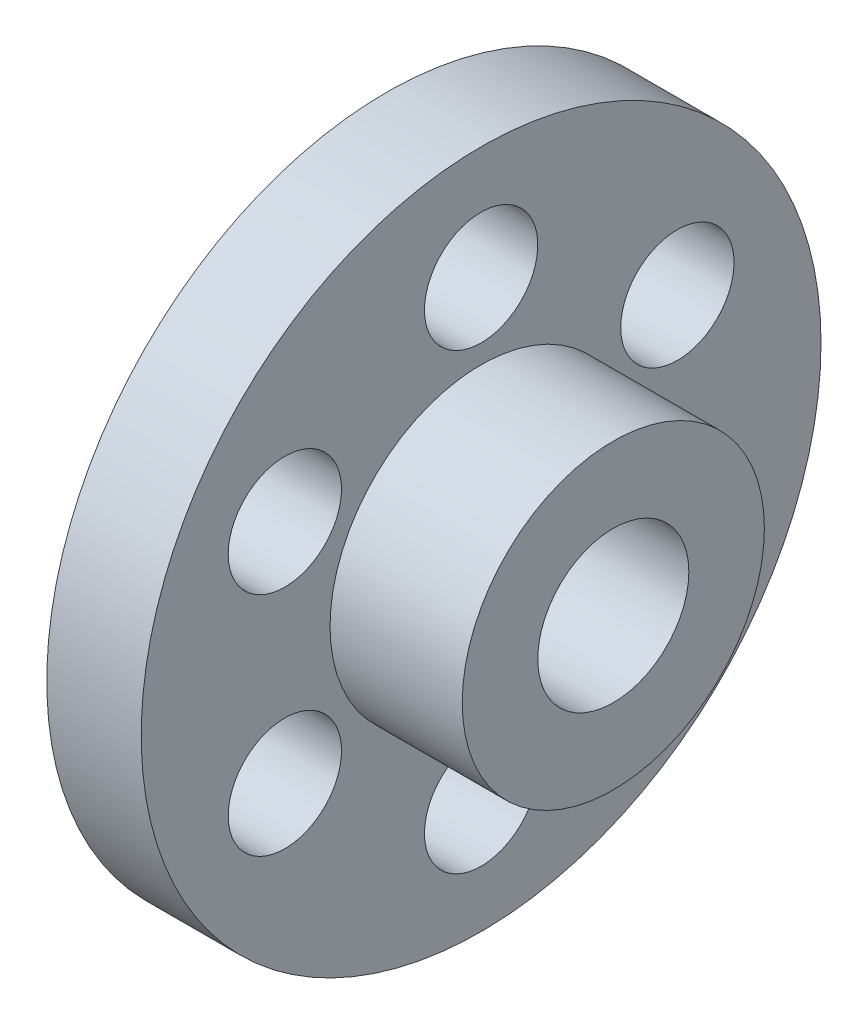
ISO-10303-21;
HEADER;
FILE_DESCRIPTION(('STEP AP214'),'2;1');
FILE_NAME('part.step','',(''),(''),'','','');
FILE_SCHEMA(('AUTOMOTIVE_DESIGN { 1 0 10303 214 1 1 1 1 }'));
ENDSEC;
DATA;
#1=APPLICATION_CONTEXT('core data for automotive mechanical design processes');
#2=APPLICATION_PROTOCOL_DEFINITION('international standard','automotive_design',2000,#1);
#3=PRODUCT_CONTEXT('',#1,'mechanical');
#4=PRODUCT('Part','Part','',(#3));
#5=PRODUCT_RELATED_PRODUCT_CATEGORY('part','',(#4));
#6=PRODUCT_DEFINITION_FORMATION('','',#4);
#7=PRODUCT_DEFINITION_CONTEXT('part definition',#1,'design');
#8=PRODUCT_DEFINITION('design','',#6,#7);
#9=PRODUCT_DEFINITION_SHAPE('','',#8);
#10=(LENGTH_UNIT() NAMED_UNIT(*) SI_UNIT(.MILLI.,.METRE.));
#11=(NAMED_UNIT(*) PLANE_ANGLE_UNIT() SI_UNIT($,.RADIAN.));
#12=(NAMED_UNIT(*) SI_UNIT($,.STERADIAN.) SOLID_ANGLE_UNIT());
#13=UNCERTAINTY_MEASURE_WITH_UNIT(LENGTH_MEASURE(1.E-05),#10,'distance_accuracy_value','');
#14=(GEOMETRIC_REPRESENTATION_CONTEXT(3) GLOBAL_UNCERTAINTY_ASSIGNED_CONTEXT((#13)) GLOBAL_UNIT_ASSIGNED_CONTEXT((#10,
#11,#12)) REPRESENTATION_CONTEXT('',''));
#15=CARTESIAN_POINT('',(0.,0.,0.));
#16=DIRECTION('',(0.,0.,1.));
#17=DIRECTION('',(1.,0.,0.));
#18=AXIS2_PLACEMENT_3D('',#15,#16,#17);
#19=CARTESIAN_POINT('',(0.,0.,0.));
#20=DIRECTION('',(-1.,0.,0.));
#21=DIRECTION('',(0.,0.,1.));
#22=AXIS2_PLACEMENT_3D('',#19,#20,#21);
#23=PLANE('',#22);
#24=CARTESIAN_POINT('',(0.,30.0000000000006,-51.961524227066));
#25=DIRECTION('',(-1.,0.,0.));
#26=DIRECTION('',(0.,0.866025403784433,0.50000000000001));
#27=AXIS2_PLACEMENT_3D('',#24,#25,#26);
#28=CIRCLE('',#27,15.);
#29=CARTESIAN_POINT('',(0.,30.0000000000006,-36.961524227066));
#30=VERTEX_POINT('',#29);
#31=EDGE_CURVE('E109',#30,#30,#28,.T.);
#32=ORIENTED_EDGE('',*,*,#31,.F.);
#33=EDGE_LOOP('',(#32));
#34=FACE_BOUND('',#33,.T.);
#35=CARTESIAN_POINT('',(0.,-29.9999999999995,-51.9615242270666));
#36=DIRECTION('',(-1.,0.,0.));
#37=DIRECTION('',(0.,0.866025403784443,-0.499999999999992));
#38=AXIS2_PLACEMENT_3D('',#35,#36,#37);
#39=CIRCLE('',#38,15.);
#40=CARTESIAN_POINT('',(0.,-29.9999999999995,-36.9615242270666));
#41=VERTEX_POINT('',#40);
#42=EDGE_CURVE('E113',#41,#41,#39,.T.);
#43=ORIENTED_EDGE('',*,*,#42,.F.);
#44=EDGE_LOOP('',(#43));
#45=FACE_BOUND('',#44,.T.);
#46=CARTESIAN_POINT('',(0.,-60.,0.));
#47=DIRECTION('',(-1.,0.,0.));
#48=DIRECTION('',(0.,0.,-1.));
#49=AXIS2_PLACEMENT_3D('',#46,#47,#48);
#50=CIRCLE('',#49,15.);
#51=CARTESIAN_POINT('',(0.,-60.,15.));
#52=VERTEX_POINT('',#51);
#53=EDGE_CURVE('E117',#52,#52,#50,.T.);
#54=ORIENTED_EDGE('',*,*,#53,.F.);
#55=EDGE_LOOP('',(#54));
#56=FACE_BOUND('',#55,.T.);
#57=CARTESIAN_POINT('',(0.,-30.0000000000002,51.9615242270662));
#58=DIRECTION('',(-1.,0.,0.));
#59=DIRECTION('',(0.,-0.866025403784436,-0.500000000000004));
#60=AXIS2_PLACEMENT_3D('',#57,#58,#59);
#61=CIRCLE('',#60,15.);
#62=CARTESIAN_POINT('',(0.,-30.0000000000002,66.9615242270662));
#63=VERTEX_POINT('',#62);
#64=EDGE_CURVE('E121',#63,#63,#61,.T.);
#65=ORIENTED_EDGE('',*,*,#64,.F.);
#66=EDGE_LOOP('',(#65));
#67=FACE_BOUND('',#66,.T.);
#68=CARTESIAN_POINT('',(0.,29.9999999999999,51.9615242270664));
#69=DIRECTION('',(-1.,0.,0.));
#70=DIRECTION('',(0.,-0.86602540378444,0.499999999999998));
#71=AXIS2_PLACEMENT_3D('',#68,#69,#70);
#72=CIRCLE('',#71,15.);
#73=CARTESIAN_POINT('',(0.,29.9999999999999,66.9615242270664));
#74=VERTEX_POINT('',#73);
#75=EDGE_CURVE('E58',#74,#74,#72,.T.);
#76=ORIENTED_EDGE('',*,*,#75,.F.);
#77=EDGE_LOOP('',(#76));
#78=FACE_BOUND('',#77,.T.);
#79=CARTESIAN_POINT('',(0.,60.,0.));
#80=DIRECTION('',(-1.,0.,0.));
#81=DIRECTION('',(0.,0.,1.));
#82=AXIS2_PLACEMENT_3D('',#79,#80,#81);
#83=CIRCLE('',#82,15.);
#84=CARTESIAN_POINT('',(0.,60.,15.));
#85=VERTEX_POINT('',#84);
#86=EDGE_CURVE('E53',#85,#85,#83,.T.);
#87=ORIENTED_EDGE('',*,*,#86,.F.);
#88=EDGE_LOOP('',(#87));
#89=FACE_BOUND('',#88,.T.);
#90=CARTESIAN_POINT('',(0.,0.,0.));
#91=DIRECTION('',(1.,0.,0.));
#92=DIRECTION('',(0.,0.,-1.));
#93=AXIS2_PLACEMENT_3D('',#90,#91,#92);
#94=CIRCLE('',#93,20.);
#95=CARTESIAN_POINT('',(0.,0.,-20.));
#96=VERTEX_POINT('',#95);
#97=EDGE_CURVE('E77',#96,#96,#94,.T.);
#98=ORIENTED_EDGE('',*,*,#97,.T.);
#99=EDGE_LOOP('',(#98));
#100=FACE_BOUND('',#99,.T.);
#101=CARTESIAN_POINT('',(0.,0.,0.));
#102=DIRECTION('',(1.,0.,0.));
#103=DIRECTION('',(0.,0.,-1.));
#104=AXIS2_PLACEMENT_3D('',#101,#102,#103);
#105=CIRCLE('',#104,90.);
#106=CARTESIAN_POINT('',(0.,0.,-90.));
#107=VERTEX_POINT('',#106);
#108=EDGE_CURVE('E10',#107,#107,#105,.T.);
#109=ORIENTED_EDGE('',*,*,#108,.F.);
#110=EDGE_LOOP('',(#109));
#111=FACE_BOUND('',#110,.T.);
#112=ADVANCED_FACE('F33',(#34,#45,#56,#67,#78,#89,#100,#111),#23,.T.);
#113=CARTESIAN_POINT('',(0.,0.,0.));
#114=DIRECTION('',(1.,0.,0.));
#115=DIRECTION('',(0.,0.,-1.));
#116=AXIS2_PLACEMENT_3D('',#113,#114,#115);
#117=CYLINDRICAL_SURFACE('',#116,90.);
#118=ORIENTED_EDGE('',*,*,#108,.T.);
#119=EDGE_LOOP('',(#118));
#120=FACE_BOUND('',#119,.T.);
#121=CARTESIAN_POINT('',(25.,0.,0.));
#122=DIRECTION('',(1.,0.,0.));
#123=DIRECTION('',(0.,0.,-1.));
#124=AXIS2_PLACEMENT_3D('',#121,#122,#123);
#125=CIRCLE('',#124,90.);
#126=CARTESIAN_POINT('',(25.,0.,-90.));
#127=VERTEX_POINT('',#126);
#128=EDGE_CURVE('E40',#127,#127,#125,.T.);
#129=ORIENTED_EDGE('',*,*,#128,.F.);
#130=EDGE_LOOP('',(#129));
#131=FACE_BOUND('',#130,.T.);
#132=ADVANCED_FACE('F92',(#120,#131),#117,.T.);
#133=CARTESIAN_POINT('',(25.,90.,0.));
#134=DIRECTION('',(1.,0.,0.));
#135=DIRECTION('',(0.,0.,-1.));
#136=AXIS2_PLACEMENT_3D('',#133,#134,#135);
#137=PLANE('',#136);
#138=CARTESIAN_POINT('',(25.,30.0000000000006,-51.961524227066));
#139=DIRECTION('',(1.,0.,0.));
#140=DIRECTION('',(0.,0.,-1.));
#141=AXIS2_PLACEMENT_3D('',#138,#139,#140);
#142=CIRCLE('',#141,15.);
#143=CARTESIAN_POINT('',(25.,30.0000000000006,-36.961524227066));
#144=VERTEX_POINT('',#143);
#145=EDGE_CURVE('E36',#144,#144,#142,.T.);
#146=ORIENTED_EDGE('',*,*,#145,.F.);
#147=EDGE_LOOP('',(#146));
#148=FACE_BOUND('',#147,.T.);
#149=CARTESIAN_POINT('',(25.,-29.9999999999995,-51.9615242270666));
#150=DIRECTION('',(1.,0.,0.));
#151=DIRECTION('',(0.,0.,-1.));
#152=AXIS2_PLACEMENT_3D('',#149,#150,#151);
#153=CIRCLE('',#152,15.);
#154=CARTESIAN_POINT('',(25.,-29.9999999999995,-36.9615242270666));
#155=VERTEX_POINT('',#154);
#156=EDGE_CURVE('E63',#155,#155,#153,.T.);
#157=ORIENTED_EDGE('',*,*,#156,.F.);
#158=EDGE_LOOP('',(#157));
#159=FACE_BOUND('',#158,.T.);
#160=CARTESIAN_POINT('',(25.,-60.,0.));
#161=DIRECTION('',(1.,0.,0.));
#162=DIRECTION('',(0.,0.,-1.));
#163=AXIS2_PLACEMENT_3D('',#160,#161,#162);
#164=CIRCLE('',#163,15.);
#165=CARTESIAN_POINT('',(25.,-60.,15.));
#166=VERTEX_POINT('',#165);
#167=EDGE_CURVE('E61',#166,#166,#164,.T.);
#168=ORIENTED_EDGE('',*,*,#167,.F.);
#169=EDGE_LOOP('',(#168));
#170=FACE_BOUND('',#169,.T.);
#171=CARTESIAN_POINT('',(25.,-30.0000000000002,51.9615242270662));
#172=DIRECTION('',(1.,0.,0.));
#173=DIRECTION('',(0.,0.,-1.));
#174=AXIS2_PLACEMENT_3D('',#171,#172,#173);
#175=CIRCLE('',#174,15.);
#176=CARTESIAN_POINT('',(25.,-30.0000000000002,66.9615242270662));
#177=VERTEX_POINT('',#176);
#178=EDGE_CURVE('E57',#177,#177,#175,.T.);
#179=ORIENTED_EDGE('',*,*,#178,.F.);
#180=EDGE_LOOP('',(#179));
#181=FACE_BOUND('',#180,.T.);
#182=CARTESIAN_POINT('',(25.,29.9999999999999,51.9615242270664));
#183=DIRECTION('',(1.,0.,0.));
#184=DIRECTION('',(0.,0.,-1.));
#185=AXIS2_PLACEMENT_3D('',#182,#183,#184);
#186=CIRCLE('',#185,15.);
#187=CARTESIAN_POINT('',(25.,29.9999999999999,66.9615242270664));
#188=VERTEX_POINT('',#187);
#189=EDGE_CURVE('E54',#188,#188,#186,.T.);
#190=ORIENTED_EDGE('',*,*,#189,.F.);
#191=EDGE_LOOP('',(#190));
#192=FACE_BOUND('',#191,.T.);
#193=CARTESIAN_POINT('',(25.,60.,0.));
#194=DIRECTION('',(1.,0.,0.));
#195=DIRECTION('',(0.,0.,-1.));
#196=AXIS2_PLACEMENT_3D('',#193,#194,#195);
#197=CIRCLE('',#196,15.);
#198=CARTESIAN_POINT('',(25.,60.,15.));
#199=VERTEX_POINT('',#198);
#200=EDGE_CURVE('E49',#199,#199,#197,.T.);
#201=ORIENTED_EDGE('',*,*,#200,.F.);
#202=EDGE_LOOP('',(#201));
#203=FACE_BOUND('',#202,.T.);
#204=ORIENTED_EDGE('',*,*,#128,.T.);
#205=EDGE_LOOP('',(#204));
#206=FACE_BOUND('',#205,.T.);
#207=CARTESIAN_POINT('',(25.,0.,0.));
#208=DIRECTION('',(1.,0.,0.));
#209=DIRECTION('',(0.,0.,-1.));
#210=AXIS2_PLACEMENT_3D('',#207,#208,#209);
#211=CIRCLE('',#210,40.);
#212=CARTESIAN_POINT('',(25.,0.,-40.));
#213=VERTEX_POINT('',#212);
#214=EDGE_CURVE('E45',#213,#213,#211,.T.);
#215=ORIENTED_EDGE('',*,*,#214,.F.);
#216=EDGE_LOOP('',(#215));
#217=FACE_BOUND('',#216,.T.);
#218=ADVANCED_FACE('F90',(#148,#159,#170,#181,#192,#203,#206,#217),#137,.T.);
#219=CARTESIAN_POINT('',(0.,0.,0.));
#220=DIRECTION('',(1.,0.,0.));
#221=DIRECTION('',(0.,0.,-1.));
#222=AXIS2_PLACEMENT_3D('',#219,#220,#221);
#223=CYLINDRICAL_SURFACE('',#222,40.);
#224=ORIENTED_EDGE('',*,*,#214,.T.);
#225=EDGE_LOOP('',(#224));
#226=FACE_BOUND('',#225,.T.);
#227=CARTESIAN_POINT('',(60.,0.,0.));
#228=DIRECTION('',(1.,0.,0.));
#229=DIRECTION('',(0.,0.,-1.));
#230=AXIS2_PLACEMENT_3D('',#227,#228,#229);
#231=CIRCLE('',#230,40.);
#232=CARTESIAN_POINT('',(60.,0.,-40.));
#233=VERTEX_POINT('',#232);
#234=EDGE_CURVE('E80',#233,#233,#231,.T.);
#235=ORIENTED_EDGE('',*,*,#234,.F.);
#236=EDGE_LOOP('',(#235));
#237=FACE_BOUND('',#236,.T.);
#238=ADVANCED_FACE('F87',(#226,#237),#223,.T.);
#239=CARTESIAN_POINT('',(60.,40.,0.));
#240=DIRECTION('',(1.,0.,0.));
#241=DIRECTION('',(0.,0.,-1.));
#242=AXIS2_PLACEMENT_3D('',#239,#240,#241);
#243=PLANE('',#242);
#244=CARTESIAN_POINT('',(60.,0.,0.));
#245=DIRECTION('',(1.,0.,0.));
#246=DIRECTION('',(0.,0.,-1.));
#247=AXIS2_PLACEMENT_3D('',#244,#245,#246);
#248=CIRCLE('',#247,20.);
#249=CARTESIAN_POINT('',(60.,0.,-20.));
#250=VERTEX_POINT('',#249);
#251=EDGE_CURVE('E52',#250,#250,#248,.T.);
#252=ORIENTED_EDGE('',*,*,#251,.F.);
#253=EDGE_LOOP('',(#252));
#254=FACE_BOUND('',#253,.T.);
#255=ORIENTED_EDGE('',*,*,#234,.T.);
#256=EDGE_LOOP('',(#255));
#257=FACE_BOUND('',#256,.T.);
#258=ADVANCED_FACE('F99',(#254,#257),#243,.T.);
#259=CARTESIAN_POINT('',(0.,0.,0.));
#260=DIRECTION('',(1.,0.,0.));
#261=DIRECTION('',(0.,0.,-1.));
#262=AXIS2_PLACEMENT_3D('',#259,#260,#261);
#263=CYLINDRICAL_SURFACE('',#262,20.);
#264=ORIENTED_EDGE('',*,*,#97,.F.);
#265=EDGE_LOOP('',(#264));
#266=FACE_BOUND('',#265,.T.);
#267=ORIENTED_EDGE('',*,*,#251,.T.);
#268=EDGE_LOOP('',(#267));
#269=FACE_BOUND('',#268,.T.);
#270=ADVANCED_FACE('F129',(#266,#269),#263,.F.);
#271=CARTESIAN_POINT('',(60.,60.,0.));
#272=DIRECTION('',(-1.,0.,0.));
#273=DIRECTION('',(0.,0.,1.));
#274=AXIS2_PLACEMENT_3D('',#271,#272,#273);
#275=CYLINDRICAL_SURFACE('',#274,15.);
#276=CARTESIAN_POINT('',(25.,60.,15.));
#277=CARTESIAN_POINT('',(24.7395833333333,60.,15.));
#278=CARTESIAN_POINT('',(24.4791666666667,60.,15.));
#279=CARTESIAN_POINT('',(23.9583333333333,60.,15.));
#280=CARTESIAN_POINT('',(23.6979166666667,60.,15.));
#281=CARTESIAN_POINT('',(23.1770833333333,60.,15.));
#282=CARTESIAN_POINT('',(22.9166666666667,60.,15.));
#283=CARTESIAN_POINT('',(22.3958333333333,60.,15.));
#284=CARTESIAN_POINT('',(22.1354166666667,60.,15.));
#285=CARTESIAN_POINT('',(21.6145833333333,60.,15.));
#286=CARTESIAN_POINT('',(21.3541666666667,60.,15.));
#287=CARTESIAN_POINT('',(20.8333333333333,60.,15.));
#288=CARTESIAN_POINT('',(20.5729166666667,60.,15.));
#289=CARTESIAN_POINT('',(20.0520833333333,60.,15.));
#290=CARTESIAN_POINT('',(19.7916666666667,60.,15.));
#291=CARTESIAN_POINT('',(19.2708333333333,60.,15.));
#292=CARTESIAN_POINT('',(19.0104166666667,60.,15.));
#293=CARTESIAN_POINT('',(18.4895833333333,60.,15.));
#294=CARTESIAN_POINT('',(18.2291666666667,60.,15.));
#295=CARTESIAN_POINT('',(17.7083333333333,60.,15.));
#296=CARTESIAN_POINT('',(17.4479166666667,60.,15.));
#297=CARTESIAN_POINT('',(16.9270833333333,60.,15.));
#298=CARTESIAN_POINT('',(16.6666666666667,60.,15.));
#299=CARTESIAN_POINT('',(16.1458333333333,60.,15.));
#300=CARTESIAN_POINT('',(15.8854166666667,60.,15.));
#301=CARTESIAN_POINT('',(15.3645833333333,60.,15.));
#302=CARTESIAN_POINT('',(15.1041666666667,60.,15.));
#303=CARTESIAN_POINT('',(14.5833333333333,60.,15.));
#304=CARTESIAN_POINT('',(14.3229166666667,60.,15.));
#305=CARTESIAN_POINT('',(13.8020833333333,60.,15.));
#306=CARTESIAN_POINT('',(13.5416666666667,60.,15.));
#307=CARTESIAN_POINT('',(13.0208333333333,60.,15.));
#308=CARTESIAN_POINT('',(12.7604166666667,60.,15.));
#309=CARTESIAN_POINT('',(12.2395833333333,60.,15.));
#310=CARTESIAN_POINT('',(11.9791666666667,60.,15.));
#311=CARTESIAN_POINT('',(11.4583333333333,60.,15.));
#312=CARTESIAN_POINT('',(11.1979166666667,60.,15.));
#313=CARTESIAN_POINT('',(10.6770833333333,60.,15.));
#314=CARTESIAN_POINT('',(10.4166666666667,60.,15.));
#315=CARTESIAN_POINT('',(9.89583333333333,60.,15.));
#316=CARTESIAN_POINT('',(9.63541666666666,60.,15.));
#317=CARTESIAN_POINT('',(9.11458333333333,60.,15.));
#318=CARTESIAN_POINT('',(8.85416666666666,60.,15.));
#319=CARTESIAN_POINT('',(8.33333333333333,60.,15.));
#320=CARTESIAN_POINT('',(8.07291666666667,60.,15.));
#321=CARTESIAN_POINT('',(7.55208333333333,60.,15.));
#322=CARTESIAN_POINT('',(7.29166666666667,60.,15.));
#323=CARTESIAN_POINT('',(6.77083333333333,60.,15.));
#324=CARTESIAN_POINT('',(6.51041666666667,60.,15.));
#325=CARTESIAN_POINT('',(5.98958333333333,60.,15.));
#326=CARTESIAN_POINT('',(5.72916666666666,60.,15.));
#327=CARTESIAN_POINT('',(5.20833333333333,60.,15.));
#328=CARTESIAN_POINT('',(4.94791666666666,60.,15.));
#329=CARTESIAN_POINT('',(4.42708333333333,60.,15.));
#330=CARTESIAN_POINT('',(4.16666666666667,60.,15.));
#331=CARTESIAN_POINT('',(3.64583333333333,60.,15.));
#332=CARTESIAN_POINT('',(3.38541666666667,60.,15.));
#333=CARTESIAN_POINT('',(2.86458333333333,60.,15.));
#334=CARTESIAN_POINT('',(2.60416666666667,60.,15.));
#335=CARTESIAN_POINT('',(2.08333333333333,60.,15.));
#336=CARTESIAN_POINT('',(1.82291666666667,60.,15.));
#337=CARTESIAN_POINT('',(1.30208333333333,60.,15.));
#338=CARTESIAN_POINT('',(1.04166666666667,60.,15.));
#339=CARTESIAN_POINT('',(0.520833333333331,60.,15.));
#340=CARTESIAN_POINT('',(0.260416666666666,60.,15.));
#341=CARTESIAN_POINT('',(0.,60.,15.));
#342=B_SPLINE_CURVE_WITH_KNOTS('',3,(#276,#277,#278,#279,#280,#281,#282,#283,#284,#285,#286,
#287,#288,#289,#290,#291,#292,#293,#294,#295,#296,#297,#298,#299,#300,#301,#302,#303,#304,#305,
#306,#307,#308,#309,#310,#311,#312,#313,#314,#315,#316,#317,#318,#319,#320,#321,#322,#323,#324,
#325,#326,#327,#328,#329,#330,#331,#332,#333,#334,#335,#336,#337,#338,#339,#340,#341),
.UNSPECIFIED.,.F.,.F.,(4,2,2,2,2,2,2,2,2,2,2,2,2,2,2,2,2,2,2,2,2,2,2,2,2,2,2,2,2,2,2,2,4),(0.,
0.781249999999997,1.5625,2.34375,3.125,3.90625,4.6875,5.46875,6.25,7.03125,7.8125,8.59375,
9.37499999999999,10.15625,10.9375,11.71875,12.5,13.28125,14.0625,14.84375,15.625,16.40625,
17.1875,17.96875,18.75,19.53125,20.3125,21.09375,21.875,22.65625,23.4375,24.21875,25.),.UNSPECIFIED.);
#343=EDGE_CURVE('BSEAM132',#199,#85,#342,.T.);
#344=ORIENTED_EDGE('',*,*,#200,.T.);
#345=ORIENTED_EDGE('',*,*,#86,.T.);
#346=ORIENTED_EDGE('',*,*,#343,.T.);
#347=ORIENTED_EDGE('',*,*,#343,.F.);
#348=EDGE_LOOP('',(#344,#346,#345,#347));
#349=FACE_BOUND('',#348,.T.);
#350=ADVANCED_FACE('F132',(#349),#275,.F.);
#351=CARTESIAN_POINT('',(60.,29.9999999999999,51.9615242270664));
#352=DIRECTION('',(-1.,0.,0.));
#353=DIRECTION('',(0.,0.,1.));
#354=AXIS2_PLACEMENT_3D('',#351,#352,#353);
#355=CYLINDRICAL_SURFACE('',#354,15.);
#356=CARTESIAN_POINT('',(25.,29.9999999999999,66.9615242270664));
#357=CARTESIAN_POINT('',(24.7395833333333,29.9999999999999,66.9615242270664));
#358=CARTESIAN_POINT('',(24.4791666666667,29.9999999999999,66.9615242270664));
#359=CARTESIAN_POINT('',(23.9583333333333,29.9999999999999,66.9615242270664));
#360=CARTESIAN_POINT('',(23.6979166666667,29.9999999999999,66.9615242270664));
#361=CARTESIAN_POINT('',(23.1770833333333,29.9999999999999,66.9615242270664));
#362=CARTESIAN_POINT('',(22.9166666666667,29.9999999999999,66.9615242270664));
#363=CARTESIAN_POINT('',(22.3958333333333,29.9999999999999,66.9615242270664));
#364=CARTESIAN_POINT('',(22.1354166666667,29.9999999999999,66.9615242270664));
#365=CARTESIAN_POINT('',(21.6145833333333,29.9999999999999,66.9615242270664));
#366=CARTESIAN_POINT('',(21.3541666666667,29.9999999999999,66.9615242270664));
#367=CARTESIAN_POINT('',(20.8333333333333,29.9999999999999,66.9615242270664));
#368=CARTESIAN_POINT('',(20.5729166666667,29.9999999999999,66.9615242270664));
#369=CARTESIAN_POINT('',(20.0520833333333,29.9999999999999,66.9615242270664));
#370=CARTESIAN_POINT('',(19.7916666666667,29.9999999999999,66.9615242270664));
#371=CARTESIAN_POINT('',(19.2708333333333,29.9999999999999,66.9615242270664));
#372=CARTESIAN_POINT('',(19.0104166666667,29.9999999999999,66.9615242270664));
#373=CARTESIAN_POINT('',(18.4895833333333,29.9999999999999,66.9615242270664));
#374=CARTESIAN_POINT('',(18.2291666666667,29.9999999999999,66.9615242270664));
#375=CARTESIAN_POINT('',(17.7083333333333,29.9999999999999,66.9615242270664));
#376=CARTESIAN_POINT('',(17.4479166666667,29.9999999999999,66.9615242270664));
#377=CARTESIAN_POINT('',(16.9270833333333,29.9999999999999,66.9615242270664));
#378=CARTESIAN_POINT('',(16.6666666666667,29.9999999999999,66.9615242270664));
#379=CARTESIAN_POINT('',(16.1458333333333,29.9999999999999,66.9615242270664));
#380=CARTESIAN_POINT('',(15.8854166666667,29.9999999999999,66.9615242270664));
#381=CARTESIAN_POINT('',(15.3645833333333,29.9999999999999,66.9615242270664));
#382=CARTESIAN_POINT('',(15.1041666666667,29.9999999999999,66.9615242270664));
#383=CARTESIAN_POINT('',(14.5833333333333,29.9999999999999,66.9615242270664));
#384=CARTESIAN_POINT('',(14.3229166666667,29.9999999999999,66.9615242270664));
#385=CARTESIAN_POINT('',(13.8020833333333,29.9999999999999,66.9615242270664));
#386=CARTESIAN_POINT('',(13.5416666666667,29.9999999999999,66.9615242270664));
#387=CARTESIAN_POINT('',(13.0208333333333,29.9999999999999,66.9615242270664));
#388=CARTESIAN_POINT('',(12.7604166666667,29.9999999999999,66.9615242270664));
#389=CARTESIAN_POINT('',(12.2395833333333,29.9999999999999,66.9615242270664));
#390=CARTESIAN_POINT('',(11.9791666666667,29.9999999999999,66.9615242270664));
#391=CARTESIAN_POINT('',(11.4583333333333,29.9999999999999,66.9615242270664));
#392=CARTESIAN_POINT('',(11.1979166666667,29.9999999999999,66.9615242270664));
#393=CARTESIAN_POINT('',(10.6770833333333,29.9999999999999,66.9615242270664));
#394=CARTESIAN_POINT('',(10.4166666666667,29.9999999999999,66.9615242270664));
#395=CARTESIAN_POINT('',(9.89583333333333,29.9999999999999,66.9615242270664));
#396=CARTESIAN_POINT('',(9.63541666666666,29.9999999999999,66.9615242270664));
#397=CARTESIAN_POINT('',(9.11458333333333,29.9999999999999,66.9615242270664));
#398=CARTESIAN_POINT('',(8.85416666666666,29.9999999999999,66.9615242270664));
#399=CARTESIAN_POINT('',(8.33333333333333,29.9999999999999,66.9615242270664));
#400=CARTESIAN_POINT('',(8.07291666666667,29.9999999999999,66.9615242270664));
#401=CARTESIAN_POINT('',(7.55208333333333,29.9999999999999,66.9615242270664));
#402=CARTESIAN_POINT('',(7.29166666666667,29.9999999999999,66.9615242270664));
#403=CARTESIAN_POINT('',(6.77083333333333,29.9999999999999,66.9615242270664));
#404=CARTESIAN_POINT('',(6.51041666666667,29.9999999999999,66.9615242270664));
#405=CARTESIAN_POINT('',(5.98958333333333,29.9999999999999,66.9615242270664));
#406=CARTESIAN_POINT('',(5.72916666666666,29.9999999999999,66.9615242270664));
#407=CARTESIAN_POINT('',(5.20833333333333,29.9999999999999,66.9615242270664));
#408=CARTESIAN_POINT('',(4.94791666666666,29.9999999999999,66.9615242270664));
#409=CARTESIAN_POINT('',(4.42708333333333,29.9999999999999,66.9615242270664));
#410=CARTESIAN_POINT('',(4.16666666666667,29.9999999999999,66.9615242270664));
#411=CARTESIAN_POINT('',(3.64583333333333,29.9999999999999,66.9615242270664));
#412=CARTESIAN_POINT('',(3.38541666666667,29.9999999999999,66.9615242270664));
#413=CARTESIAN_POINT('',(2.86458333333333,29.9999999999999,66.9615242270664));
#414=CARTESIAN_POINT('',(2.60416666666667,29.9999999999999,66.9615242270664));
#415=CARTESIAN_POINT('',(2.08333333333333,29.9999999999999,66.9615242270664));
#416=CARTESIAN_POINT('',(1.82291666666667,29.9999999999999,66.9615242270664));
#417=CARTESIAN_POINT('',(1.30208333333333,29.9999999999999,66.9615242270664));
#418=CARTESIAN_POINT('',(1.04166666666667,29.9999999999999,66.9615242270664));
#419=CARTESIAN_POINT('',(0.520833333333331,29.9999999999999,66.9615242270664));
#420=CARTESIAN_POINT('',(0.260416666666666,29.9999999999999,66.9615242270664));
#421=CARTESIAN_POINT('',(0.,29.9999999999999,66.9615242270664));
#422=B_SPLINE_CURVE_WITH_KNOTS('',3,(#356,#357,#358,#359,#360,#361,#362,#363,#364,#365,#366,
#367,#368,#369,#370,#371,#372,#373,#374,#375,#376,#377,#378,#379,#380,#381,#382,#383,#384,#385,
#386,#387,#388,#389,#390,#391,#392,#393,#394,#395,#396,#397,#398,#399,#400,#401,#402,#403,#404,
#405,#406,#407,#408,#409,#410,#411,#412,#413,#414,#415,#416,#417,#418,#419,#420,#421),
.UNSPECIFIED.,.F.,.F.,(4,2,2,2,2,2,2,2,2,2,2,2,2,2,2,2,2,2,2,2,2,2,2,2,2,2,2,2,2,2,2,2,4),(0.,
0.781249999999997,1.5625,2.34375,3.125,3.90625,4.6875,5.46875,6.25,7.03125,7.8125,8.59375,
9.37499999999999,10.15625,10.9375,11.71875,12.5,13.28125,14.0625,14.84375,15.625,16.40625,
17.1875,17.96875,18.75,19.53125,20.3125,21.09375,21.875,22.65625,23.4375,24.21875,25.),.UNSPECIFIED.);
#423=EDGE_CURVE('BSEAM145',#188,#74,#422,.T.);
#424=ORIENTED_EDGE('',*,*,#189,.T.);
#425=ORIENTED_EDGE('',*,*,#75,.T.);
#426=ORIENTED_EDGE('',*,*,#423,.T.);
#427=ORIENTED_EDGE('',*,*,#423,.F.);
#428=EDGE_LOOP('',(#424,#426,#425,#427));
#429=FACE_BOUND('',#428,.T.);
#430=ADVANCED_FACE('F145',(#429),#355,.F.);
#431=CARTESIAN_POINT('',(60.,-30.0000000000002,51.9615242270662));
#432=DIRECTION('',(-1.,0.,0.));
#433=DIRECTION('',(0.,0.,1.));
#434=AXIS2_PLACEMENT_3D('',#431,#432,#433);
#435=CYLINDRICAL_SURFACE('',#434,15.);
#436=CARTESIAN_POINT('',(25.,-30.0000000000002,66.9615242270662));
#437=CARTESIAN_POINT('',(24.7395833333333,-30.0000000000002,66.9615242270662));
#438=CARTESIAN_POINT('',(24.4791666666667,-30.0000000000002,66.9615242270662));
#439=CARTESIAN_POINT('',(23.9583333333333,-30.0000000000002,66.9615242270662));
#440=CARTESIAN_POINT('',(23.6979166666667,-30.0000000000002,66.9615242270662));
#441=CARTESIAN_POINT('',(23.1770833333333,-30.0000000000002,66.9615242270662));
#442=CARTESIAN_POINT('',(22.9166666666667,-30.0000000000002,66.9615242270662));
#443=CARTESIAN_POINT('',(22.3958333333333,-30.0000000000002,66.9615242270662));
#444=CARTESIAN_POINT('',(22.1354166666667,-30.0000000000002,66.9615242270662));
#445=CARTESIAN_POINT('',(21.6145833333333,-30.0000000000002,66.9615242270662));
#446=CARTESIAN_POINT('',(21.3541666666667,-30.0000000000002,66.9615242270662));
#447=CARTESIAN_POINT('',(20.8333333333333,-30.0000000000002,66.9615242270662));
#448=CARTESIAN_POINT('',(20.5729166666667,-30.0000000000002,66.9615242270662));
#449=CARTESIAN_POINT('',(20.0520833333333,-30.0000000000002,66.9615242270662));
#450=CARTESIAN_POINT('',(19.7916666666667,-30.0000000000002,66.9615242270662));
#451=CARTESIAN_POINT('',(19.2708333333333,-30.0000000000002,66.9615242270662));
#452=CARTESIAN_POINT('',(19.0104166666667,-30.0000000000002,66.9615242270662));
#453=CARTESIAN_POINT('',(18.4895833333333,-30.0000000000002,66.9615242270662));
#454=CARTESIAN_POINT('',(18.2291666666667,-30.0000000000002,66.9615242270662));
#455=CARTESIAN_POINT('',(17.7083333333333,-30.0000000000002,66.9615242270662));
#456=CARTESIAN_POINT('',(17.4479166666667,-30.0000000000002,66.9615242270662));
#457=CARTESIAN_POINT('',(16.9270833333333,-30.0000000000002,66.9615242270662));
#458=CARTESIAN_POINT('',(16.6666666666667,-30.0000000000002,66.9615242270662));
#459=CARTESIAN_POINT('',(16.1458333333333,-30.0000000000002,66.9615242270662));
#460=CARTESIAN_POINT('',(15.8854166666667,-30.0000000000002,66.9615242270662));
#461=CARTESIAN_POINT('',(15.3645833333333,-30.0000000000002,66.9615242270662));
#462=CARTESIAN_POINT('',(15.1041666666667,-30.0000000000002,66.9615242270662));
#463=CARTESIAN_POINT('',(14.5833333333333,-30.0000000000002,66.9615242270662));
#464=CARTESIAN_POINT('',(14.3229166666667,-30.0000000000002,66.9615242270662));
#465=CARTESIAN_POINT('',(13.8020833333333,-30.0000000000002,66.9615242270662));
#466=CARTESIAN_POINT('',(13.5416666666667,-30.0000000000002,66.9615242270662));
#467=CARTESIAN_POINT('',(13.0208333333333,-30.0000000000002,66.9615242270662));
#468=CARTESIAN_POINT('',(12.7604166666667,-30.0000000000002,66.9615242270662));
#469=CARTESIAN_POINT('',(12.2395833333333,-30.0000000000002,66.9615242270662));
#470=CARTESIAN_POINT('',(11.9791666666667,-30.0000000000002,66.9615242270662));
#471=CARTESIAN_POINT('',(11.4583333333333,-30.0000000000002,66.9615242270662));
#472=CARTESIAN_POINT('',(11.1979166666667,-30.0000000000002,66.9615242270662));
#473=CARTESIAN_POINT('',(10.6770833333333,-30.0000000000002,66.9615242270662));
#474=CARTESIAN_POINT('',(10.4166666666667,-30.0000000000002,66.9615242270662));
#475=CARTESIAN_POINT('',(9.89583333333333,-30.0000000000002,66.9615242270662));
#476=CARTESIAN_POINT('',(9.63541666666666,-30.0000000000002,66.9615242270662));
#477=CARTESIAN_POINT('',(9.11458333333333,-30.0000000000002,66.9615242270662));
#478=CARTESIAN_POINT('',(8.85416666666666,-30.0000000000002,66.9615242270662));
#479=CARTESIAN_POINT('',(8.33333333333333,-30.0000000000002,66.9615242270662));
#480=CARTESIAN_POINT('',(8.07291666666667,-30.0000000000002,66.9615242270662));
#481=CARTESIAN_POINT('',(7.55208333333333,-30.0000000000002,66.9615242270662));
#482=CARTESIAN_POINT('',(7.29166666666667,-30.0000000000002,66.9615242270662));
#483=CARTESIAN_POINT('',(6.77083333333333,-30.0000000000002,66.9615242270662));
#484=CARTESIAN_POINT('',(6.51041666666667,-30.0000000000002,66.9615242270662));
#485=CARTESIAN_POINT('',(5.98958333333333,-30.0000000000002,66.9615242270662));
#486=CARTESIAN_POINT('',(5.72916666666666,-30.0000000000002,66.9615242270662));
#487=CARTESIAN_POINT('',(5.20833333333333,-30.0000000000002,66.9615242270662));
#488=CARTESIAN_POINT('',(4.94791666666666,-30.0000000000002,66.9615242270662));
#489=CARTESIAN_POINT('',(4.42708333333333,-30.0000000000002,66.9615242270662));
#490=CARTESIAN_POINT('',(4.16666666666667,-30.0000000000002,66.9615242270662));
#491=CARTESIAN_POINT('',(3.64583333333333,-30.0000000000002,66.9615242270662));
#492=CARTESIAN_POINT('',(3.38541666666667,-30.0000000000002,66.9615242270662));
#493=CARTESIAN_POINT('',(2.86458333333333,-30.0000000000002,66.9615242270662));
#494=CARTESIAN_POINT('',(2.60416666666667,-30.0000000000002,66.9615242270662));
#495=CARTESIAN_POINT('',(2.08333333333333,-30.0000000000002,66.9615242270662));
#496=CARTESIAN_POINT('',(1.82291666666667,-30.0000000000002,66.9615242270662));
#497=CARTESIAN_POINT('',(1.30208333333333,-30.0000000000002,66.9615242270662));
#498=CARTESIAN_POINT('',(1.04166666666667,-30.0000000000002,66.9615242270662));
#499=CARTESIAN_POINT('',(0.520833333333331,-30.0000000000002,66.9615242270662));
#500=CARTESIAN_POINT('',(0.260416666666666,-30.0000000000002,66.9615242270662));
#501=CARTESIAN_POINT('',(0.,-30.0000000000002,66.9615242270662));
#502=B_SPLINE_CURVE_WITH_KNOTS('',3,(#436,#437,#438,#439,#440,#441,#442,#443,#444,#445,#446,
#447,#448,#449,#450,#451,#452,#453,#454,#455,#456,#457,#458,#459,#460,#461,#462,#463,#464,#465,
#466,#467,#468,#469,#470,#471,#472,#473,#474,#475,#476,#477,#478,#479,#480,#481,#482,#483,#484,
#485,#486,#487,#488,#489,#490,#491,#492,#493,#494,#495,#496,#497,#498,#499,#500,#501),
.UNSPECIFIED.,.F.,.F.,(4,2,2,2,2,2,2,2,2,2,2,2,2,2,2,2,2,2,2,2,2,2,2,2,2,2,2,2,2,2,2,2,4),(0.,
0.781249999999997,1.5625,2.34375,3.125,3.90625,4.6875,5.46875,6.25,7.03125,7.8125,8.59375,
9.37499999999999,10.15625,10.9375,11.71875,12.5,13.28125,14.0625,14.84375,15.625,16.40625,
17.1875,17.96875,18.75,19.53125,20.3125,21.09375,21.875,22.65625,23.4375,24.21875,25.),.UNSPECIFIED.);
#503=EDGE_CURVE('BSEAM149',#177,#63,#502,.T.);
#504=ORIENTED_EDGE('',*,*,#178,.T.);
#505=ORIENTED_EDGE('',*,*,#64,.T.);
#506=ORIENTED_EDGE('',*,*,#503,.T.);
#507=ORIENTED_EDGE('',*,*,#503,.F.);
#508=EDGE_LOOP('',(#504,#506,#505,#507));
#509=FACE_BOUND('',#508,.T.);
#510=ADVANCED_FACE('F149',(#509),#435,.F.);
#511=CARTESIAN_POINT('',(60.,-60.,0.));
#512=DIRECTION('',(-1.,0.,0.));
#513=DIRECTION('',(0.,0.,1.));
#514=AXIS2_PLACEMENT_3D('',#511,#512,#513);
#515=CYLINDRICAL_SURFACE('',#514,15.);
#516=CARTESIAN_POINT('',(25.,-60.,15.));
#517=CARTESIAN_POINT('',(24.7395833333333,-60.,15.));
#518=CARTESIAN_POINT('',(24.4791666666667,-60.,15.));
#519=CARTESIAN_POINT('',(23.9583333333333,-60.,15.));
#520=CARTESIAN_POINT('',(23.6979166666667,-60.,15.));
#521=CARTESIAN_POINT('',(23.1770833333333,-60.,15.));
#522=CARTESIAN_POINT('',(22.9166666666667,-60.,15.));
#523=CARTESIAN_POINT('',(22.3958333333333,-60.,15.));
#524=CARTESIAN_POINT('',(22.1354166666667,-60.,15.));
#525=CARTESIAN_POINT('',(21.6145833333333,-60.,15.));
#526=CARTESIAN_POINT('',(21.3541666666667,-60.,15.));
#527=CARTESIAN_POINT('',(20.8333333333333,-60.,15.));
#528=CARTESIAN_POINT('',(20.5729166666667,-60.,15.));
#529=CARTESIAN_POINT('',(20.0520833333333,-60.,15.));
#530=CARTESIAN_POINT('',(19.7916666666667,-60.,15.));
#531=CARTESIAN_POINT('',(19.2708333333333,-60.,15.));
#532=CARTESIAN_POINT('',(19.0104166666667,-60.,15.));
#533=CARTESIAN_POINT('',(18.4895833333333,-60.,15.));
#534=CARTESIAN_POINT('',(18.2291666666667,-60.,15.));
#535=CARTESIAN_POINT('',(17.7083333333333,-60.,15.));
#536=CARTESIAN_POINT('',(17.4479166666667,-60.,15.));
#537=CARTESIAN_POINT('',(16.9270833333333,-60.,15.));
#538=CARTESIAN_POINT('',(16.6666666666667,-60.,15.));
#539=CARTESIAN_POINT('',(16.1458333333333,-60.,15.));
#540=CARTESIAN_POINT('',(15.8854166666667,-60.,15.));
#541=CARTESIAN_POINT('',(15.3645833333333,-60.,15.));
#542=CARTESIAN_POINT('',(15.1041666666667,-60.,15.));
#543=CARTESIAN_POINT('',(14.5833333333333,-60.,15.));
#544=CARTESIAN_POINT('',(14.3229166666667,-60.,15.));
#545=CARTESIAN_POINT('',(13.8020833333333,-60.,15.));
#546=CARTESIAN_POINT('',(13.5416666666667,-60.,15.));
#547=CARTESIAN_POINT('',(13.0208333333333,-60.,15.));
#548=CARTESIAN_POINT('',(12.7604166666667,-60.,15.));
#549=CARTESIAN_POINT('',(12.2395833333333,-60.,15.));
#550=CARTESIAN_POINT('',(11.9791666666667,-60.,15.));
#551=CARTESIAN_POINT('',(11.4583333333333,-60.,15.));
#552=CARTESIAN_POINT('',(11.1979166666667,-60.,15.));
#553=CARTESIAN_POINT('',(10.6770833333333,-60.,15.));
#554=CARTESIAN_POINT('',(10.4166666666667,-60.,15.));
#555=CARTESIAN_POINT('',(9.89583333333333,-60.,15.));
#556=CARTESIAN_POINT('',(9.63541666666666,-60.,15.));
#557=CARTESIAN_POINT('',(9.11458333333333,-60.,15.));
#558=CARTESIAN_POINT('',(8.85416666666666,-60.,15.));
#559=CARTESIAN_POINT('',(8.33333333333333,-60.,15.));
#560=CARTESIAN_POINT('',(8.07291666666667,-60.,15.));
#561=CARTESIAN_POINT('',(7.55208333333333,-60.,15.));
#562=CARTESIAN_POINT('',(7.29166666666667,-60.,15.));
#563=CARTESIAN_POINT('',(6.77083333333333,-60.,15.));
#564=CARTESIAN_POINT('',(6.51041666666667,-60.,15.));
#565=CARTESIAN_POINT('',(5.98958333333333,-60.,15.));
#566=CARTESIAN_POINT('',(5.72916666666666,-60.,15.));
#567=CARTESIAN_POINT('',(5.20833333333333,-60.,15.));
#568=CARTESIAN_POINT('',(4.94791666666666,-60.,15.));
#569=CARTESIAN_POINT('',(4.42708333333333,-60.,15.));
#570=CARTESIAN_POINT('',(4.16666666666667,-60.,15.));
#571=CARTESIAN_POINT('',(3.64583333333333,-60.,15.));
#572=CARTESIAN_POINT('',(3.38541666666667,-60.,15.));
#573=CARTESIAN_POINT('',(2.86458333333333,-60.,15.));
#574=CARTESIAN_POINT('',(2.60416666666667,-60.,15.));
#575=CARTESIAN_POINT('',(2.08333333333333,-60.,15.));
#576=CARTESIAN_POINT('',(1.82291666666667,-60.,15.));
#577=CARTESIAN_POINT('',(1.30208333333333,-60.,15.));
#578=CARTESIAN_POINT('',(1.04166666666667,-60.,15.));
#579=CARTESIAN_POINT('',(0.520833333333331,-60.,15.));
#580=CARTESIAN_POINT('',(0.260416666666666,-60.,15.));
#581=CARTESIAN_POINT('',(0.,-60.,15.));
#582=B_SPLINE_CURVE_WITH_KNOTS('',3,(#516,#517,#518,#519,#520,#521,#522,#523,#524,#525,#526,
#527,#528,#529,#530,#531,#532,#533,#534,#535,#536,#537,#538,#539,#540,#541,#542,#543,#544,#545,
#546,#547,#548,#549,#550,#551,#552,#553,#554,#555,#556,#557,#558,#559,#560,#561,#562,#563,#564,
#565,#566,#567,#568,#569,#570,#571,#572,#573,#574,#575,#576,#577,#578,#579,#580,#581),
.UNSPECIFIED.,.F.,.F.,(4,2,2,2,2,2,2,2,2,2,2,2,2,2,2,2,2,2,2,2,2,2,2,2,2,2,2,2,2,2,2,2,4),(0.,
0.781249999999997,1.5625,2.34375,3.125,3.90625,4.6875,5.46875,6.25,7.03125,7.8125,8.59375,
9.37499999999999,10.15625,10.9375,11.71875,12.5,13.28125,14.0625,14.84375,15.625,16.40625,
17.1875,17.96875,18.75,19.53125,20.3125,21.09375,21.875,22.65625,23.4375,24.21875,25.),.UNSPECIFIED.);
#583=EDGE_CURVE('BSEAM157',#166,#52,#582,.T.);
#584=ORIENTED_EDGE('',*,*,#167,.T.);
#585=ORIENTED_EDGE('',*,*,#53,.T.);
#586=ORIENTED_EDGE('',*,*,#583,.T.);
#587=ORIENTED_EDGE('',*,*,#583,.F.);
#588=EDGE_LOOP('',(#584,#586,#585,#587));
#589=FACE_BOUND('',#588,.T.);
#590=ADVANCED_FACE('F157',(#589),#515,.F.);
#591=CARTESIAN_POINT('',(60.,-29.9999999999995,-51.9615242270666));
#592=DIRECTION('',(-1.,0.,0.));
#593=DIRECTION('',(0.,0.,1.));
#594=AXIS2_PLACEMENT_3D('',#591,#592,#593);
#595=CYLINDRICAL_SURFACE('',#594,15.);
#596=CARTESIAN_POINT('',(25.,-29.9999999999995,-36.9615242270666));
#597=CARTESIAN_POINT('',(24.7395833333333,-29.9999999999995,-36.9615242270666));
#598=CARTESIAN_POINT('',(24.4791666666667,-29.9999999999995,-36.9615242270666));
#599=CARTESIAN_POINT('',(23.9583333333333,-29.9999999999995,-36.9615242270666));
#600=CARTESIAN_POINT('',(23.6979166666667,-29.9999999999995,-36.9615242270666));
#601=CARTESIAN_POINT('',(23.1770833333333,-29.9999999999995,-36.9615242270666));
#602=CARTESIAN_POINT('',(22.9166666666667,-29.9999999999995,-36.9615242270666));
#603=CARTESIAN_POINT('',(22.3958333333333,-29.9999999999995,-36.9615242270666));
#604=CARTESIAN_POINT('',(22.1354166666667,-29.9999999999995,-36.9615242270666));
#605=CARTESIAN_POINT('',(21.6145833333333,-29.9999999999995,-36.9615242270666));
#606=CARTESIAN_POINT('',(21.3541666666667,-29.9999999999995,-36.9615242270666));
#607=CARTESIAN_POINT('',(20.8333333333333,-29.9999999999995,-36.9615242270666));
#608=CARTESIAN_POINT('',(20.5729166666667,-29.9999999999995,-36.9615242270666));
#609=CARTESIAN_POINT('',(20.0520833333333,-29.9999999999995,-36.9615242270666));
#610=CARTESIAN_POINT('',(19.7916666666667,-29.9999999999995,-36.9615242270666));
#611=CARTESIAN_POINT('',(19.2708333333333,-29.9999999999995,-36.9615242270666));
#612=CARTESIAN_POINT('',(19.0104166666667,-29.9999999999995,-36.9615242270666));
#613=CARTESIAN_POINT('',(18.4895833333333,-29.9999999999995,-36.9615242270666));
#614=CARTESIAN_POINT('',(18.2291666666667,-29.9999999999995,-36.9615242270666));
#615=CARTESIAN_POINT('',(17.7083333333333,-29.9999999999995,-36.9615242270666));
#616=CARTESIAN_POINT('',(17.4479166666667,-29.9999999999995,-36.9615242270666));
#617=CARTESIAN_POINT('',(16.9270833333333,-29.9999999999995,-36.9615242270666));
#618=CARTESIAN_POINT('',(16.6666666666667,-29.9999999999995,-36.9615242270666));
#619=CARTESIAN_POINT('',(16.1458333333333,-29.9999999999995,-36.9615242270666));
#620=CARTESIAN_POINT('',(15.8854166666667,-29.9999999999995,-36.9615242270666));
#621=CARTESIAN_POINT('',(15.3645833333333,-29.9999999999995,-36.9615242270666));
#622=CARTESIAN_POINT('',(15.1041666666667,-29.9999999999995,-36.9615242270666));
#623=CARTESIAN_POINT('',(14.5833333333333,-29.9999999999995,-36.9615242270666));
#624=CARTESIAN_POINT('',(14.3229166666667,-29.9999999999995,-36.9615242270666));
#625=CARTESIAN_POINT('',(13.8020833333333,-29.9999999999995,-36.9615242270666));
#626=CARTESIAN_POINT('',(13.5416666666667,-29.9999999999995,-36.9615242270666));
#627=CARTESIAN_POINT('',(13.0208333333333,-29.9999999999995,-36.9615242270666));
#628=CARTESIAN_POINT('',(12.7604166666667,-29.9999999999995,-36.9615242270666));
#629=CARTESIAN_POINT('',(12.2395833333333,-29.9999999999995,-36.9615242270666));
#630=CARTESIAN_POINT('',(11.9791666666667,-29.9999999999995,-36.9615242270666));
#631=CARTESIAN_POINT('',(11.4583333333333,-29.9999999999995,-36.9615242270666));
#632=CARTESIAN_POINT('',(11.1979166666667,-29.9999999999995,-36.9615242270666));
#633=CARTESIAN_POINT('',(10.6770833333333,-29.9999999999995,-36.9615242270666));
#634=CARTESIAN_POINT('',(10.4166666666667,-29.9999999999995,-36.9615242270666));
#635=CARTESIAN_POINT('',(9.89583333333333,-29.9999999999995,-36.9615242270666));
#636=CARTESIAN_POINT('',(9.63541666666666,-29.9999999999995,-36.9615242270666));
#637=CARTESIAN_POINT('',(9.11458333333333,-29.9999999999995,-36.9615242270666));
#638=CARTESIAN_POINT('',(8.85416666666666,-29.9999999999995,-36.9615242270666));
#639=CARTESIAN_POINT('',(8.33333333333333,-29.9999999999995,-36.9615242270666));
#640=CARTESIAN_POINT('',(8.07291666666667,-29.9999999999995,-36.9615242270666));
#641=CARTESIAN_POINT('',(7.55208333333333,-29.9999999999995,-36.9615242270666));
#642=CARTESIAN_POINT('',(7.29166666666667,-29.9999999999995,-36.9615242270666));
#643=CARTESIAN_POINT('',(6.77083333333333,-29.9999999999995,-36.9615242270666));
#644=CARTESIAN_POINT('',(6.51041666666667,-29.9999999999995,-36.9615242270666));
#645=CARTESIAN_POINT('',(5.98958333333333,-29.9999999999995,-36.9615242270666));
#646=CARTESIAN_POINT('',(5.72916666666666,-29.9999999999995,-36.9615242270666));
#647=CARTESIAN_POINT('',(5.20833333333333,-29.9999999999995,-36.9615242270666));
#648=CARTESIAN_POINT('',(4.94791666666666,-29.9999999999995,-36.9615242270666));
#649=CARTESIAN_POINT('',(4.42708333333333,-29.9999999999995,-36.9615242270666));
#650=CARTESIAN_POINT('',(4.16666666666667,-29.9999999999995,-36.9615242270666));
#651=CARTESIAN_POINT('',(3.64583333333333,-29.9999999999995,-36.9615242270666));
#652=CARTESIAN_POINT('',(3.38541666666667,-29.9999999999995,-36.9615242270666));
#653=CARTESIAN_POINT('',(2.86458333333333,-29.9999999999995,-36.9615242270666));
#654=CARTESIAN_POINT('',(2.60416666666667,-29.9999999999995,-36.9615242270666));
#655=CARTESIAN_POINT('',(2.08333333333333,-29.9999999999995,-36.9615242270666));
#656=CARTESIAN_POINT('',(1.82291666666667,-29.9999999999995,-36.9615242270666));
#657=CARTESIAN_POINT('',(1.30208333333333,-29.9999999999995,-36.9615242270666));
#658=CARTESIAN_POINT('',(1.04166666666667,-29.9999999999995,-36.9615242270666));
#659=CARTESIAN_POINT('',(0.520833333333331,-29.9999999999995,-36.9615242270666));
#660=CARTESIAN_POINT('',(0.260416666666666,-29.9999999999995,-36.9615242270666));
#661=CARTESIAN_POINT('',(0.,-29.9999999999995,-36.9615242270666));
#662=B_SPLINE_CURVE_WITH_KNOTS('',3,(#596,#597,#598,#599,#600,#601,#602,#603,#604,#605,#606,
#607,#608,#609,#610,#611,#612,#613,#614,#615,#616,#617,#618,#619,#620,#621,#622,#623,#624,#625,
#626,#627,#628,#629,#630,#631,#632,#633,#634,#635,#636,#637,#638,#639,#640,#641,#642,#643,#644,
#645,#646,#647,#648,#649,#650,#651,#652,#653,#654,#655,#656,#657,#658,#659,#660,#661),
.UNSPECIFIED.,.F.,.F.,(4,2,2,2,2,2,2,2,2,2,2,2,2,2,2,2,2,2,2,2,2,2,2,2,2,2,2,2,2,2,2,2,4),(0.,
0.781249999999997,1.5625,2.34375,3.125,3.90625,4.6875,5.46875,6.25,7.03125,7.8125,8.59375,
9.37499999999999,10.15625,10.9375,11.71875,12.5,13.28125,14.0625,14.84375,15.625,16.40625,
17.1875,17.96875,18.75,19.53125,20.3125,21.09375,21.875,22.65625,23.4375,24.21875,25.),.UNSPECIFIED.);
#663=EDGE_CURVE('BSEAM154',#155,#41,#662,.T.);
#664=ORIENTED_EDGE('',*,*,#156,.T.);
#665=ORIENTED_EDGE('',*,*,#42,.T.);
#666=ORIENTED_EDGE('',*,*,#663,.T.);
#667=ORIENTED_EDGE('',*,*,#663,.F.);
#668=EDGE_LOOP('',(#664,#666,#665,#667));
#669=FACE_BOUND('',#668,.T.);
#670=ADVANCED_FACE('F154',(#669),#595,.F.);
#671=CARTESIAN_POINT('',(60.,30.0000000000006,-51.961524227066));
#672=DIRECTION('',(-1.,0.,0.));
#673=DIRECTION('',(0.,0.,1.));
#674=AXIS2_PLACEMENT_3D('',#671,#672,#673);
#675=CYLINDRICAL_SURFACE('',#674,15.);
#676=CARTESIAN_POINT('',(25.,30.0000000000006,-36.961524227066));
#677=CARTESIAN_POINT('',(24.7395833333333,30.0000000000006,-36.961524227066));
#678=CARTESIAN_POINT('',(24.4791666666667,30.0000000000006,-36.961524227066));
#679=CARTESIAN_POINT('',(23.9583333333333,30.0000000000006,-36.961524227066));
#680=CARTESIAN_POINT('',(23.6979166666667,30.0000000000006,-36.961524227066));
#681=CARTESIAN_POINT('',(23.1770833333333,30.0000000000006,-36.961524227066));
#682=CARTESIAN_POINT('',(22.9166666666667,30.0000000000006,-36.961524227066));
#683=CARTESIAN_POINT('',(22.3958333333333,30.0000000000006,-36.961524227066));
#684=CARTESIAN_POINT('',(22.1354166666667,30.0000000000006,-36.961524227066));
#685=CARTESIAN_POINT('',(21.6145833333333,30.0000000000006,-36.961524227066));
#686=CARTESIAN_POINT('',(21.3541666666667,30.0000000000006,-36.961524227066));
#687=CARTESIAN_POINT('',(20.8333333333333,30.0000000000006,-36.961524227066));
#688=CARTESIAN_POINT('',(20.5729166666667,30.0000000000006,-36.961524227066));
#689=CARTESIAN_POINT('',(20.0520833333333,30.0000000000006,-36.961524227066));
#690=CARTESIAN_POINT('',(19.7916666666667,30.0000000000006,-36.961524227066));
#691=CARTESIAN_POINT('',(19.2708333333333,30.0000000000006,-36.961524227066));
#692=CARTESIAN_POINT('',(19.0104166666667,30.0000000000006,-36.961524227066));
#693=CARTESIAN_POINT('',(18.4895833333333,30.0000000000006,-36.961524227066));
#694=CARTESIAN_POINT('',(18.2291666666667,30.0000000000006,-36.961524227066));
#695=CARTESIAN_POINT('',(17.7083333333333,30.0000000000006,-36.961524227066));
#696=CARTESIAN_POINT('',(17.4479166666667,30.0000000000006,-36.961524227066));
#697=CARTESIAN_POINT('',(16.9270833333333,30.0000000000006,-36.961524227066));
#698=CARTESIAN_POINT('',(16.6666666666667,30.0000000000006,-36.961524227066));
#699=CARTESIAN_POINT('',(16.1458333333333,30.0000000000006,-36.961524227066));
#700=CARTESIAN_POINT('',(15.8854166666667,30.0000000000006,-36.961524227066));
#701=CARTESIAN_POINT('',(15.3645833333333,30.0000000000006,-36.961524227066));
#702=CARTESIAN_POINT('',(15.1041666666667,30.0000000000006,-36.961524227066));
#703=CARTESIAN_POINT('',(14.5833333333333,30.0000000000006,-36.961524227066));
#704=CARTESIAN_POINT('',(14.3229166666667,30.0000000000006,-36.961524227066));
#705=CARTESIAN_POINT('',(13.8020833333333,30.0000000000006,-36.961524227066));
#706=CARTESIAN_POINT('',(13.5416666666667,30.0000000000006,-36.961524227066));
#707=CARTESIAN_POINT('',(13.0208333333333,30.0000000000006,-36.961524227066));
#708=CARTESIAN_POINT('',(12.7604166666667,30.0000000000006,-36.961524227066));
#709=CARTESIAN_POINT('',(12.2395833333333,30.0000000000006,-36.961524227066));
#710=CARTESIAN_POINT('',(11.9791666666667,30.0000000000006,-36.961524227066));
#711=CARTESIAN_POINT('',(11.4583333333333,30.0000000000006,-36.961524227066));
#712=CARTESIAN_POINT('',(11.1979166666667,30.0000000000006,-36.961524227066));
#713=CARTESIAN_POINT('',(10.6770833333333,30.0000000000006,-36.961524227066));
#714=CARTESIAN_POINT('',(10.4166666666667,30.0000000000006,-36.961524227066));
#715=CARTESIAN_POINT('',(9.89583333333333,30.0000000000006,-36.961524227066));
#716=CARTESIAN_POINT('',(9.63541666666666,30.0000000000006,-36.961524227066));
#717=CARTESIAN_POINT('',(9.11458333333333,30.0000000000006,-36.961524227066));
#718=CARTESIAN_POINT('',(8.85416666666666,30.0000000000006,-36.961524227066));
#719=CARTESIAN_POINT('',(8.33333333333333,30.0000000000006,-36.961524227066));
#720=CARTESIAN_POINT('',(8.07291666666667,30.0000000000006,-36.961524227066));
#721=CARTESIAN_POINT('',(7.55208333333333,30.0000000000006,-36.961524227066));
#722=CARTESIAN_POINT('',(7.29166666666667,30.0000000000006,-36.961524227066));
#723=CARTESIAN_POINT('',(6.77083333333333,30.0000000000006,-36.961524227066));
#724=CARTESIAN_POINT('',(6.51041666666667,30.0000000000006,-36.961524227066));
#725=CARTESIAN_POINT('',(5.98958333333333,30.0000000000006,-36.961524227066));
#726=CARTESIAN_POINT('',(5.72916666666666,30.0000000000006,-36.961524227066));
#727=CARTESIAN_POINT('',(5.20833333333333,30.0000000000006,-36.961524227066));
#728=CARTESIAN_POINT('',(4.94791666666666,30.0000000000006,-36.961524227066));
#729=CARTESIAN_POINT('',(4.42708333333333,30.0000000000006,-36.961524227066));
#730=CARTESIAN_POINT('',(4.16666666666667,30.0000000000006,-36.961524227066));
#731=CARTESIAN_POINT('',(3.64583333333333,30.0000000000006,-36.961524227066));
#732=CARTESIAN_POINT('',(3.38541666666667,30.0000000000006,-36.961524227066));
#733=CARTESIAN_POINT('',(2.86458333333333,30.0000000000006,-36.961524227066));
#734=CARTESIAN_POINT('',(2.60416666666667,30.0000000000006,-36.961524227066));
#735=CARTESIAN_POINT('',(2.08333333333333,30.0000000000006,-36.961524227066));
#736=CARTESIAN_POINT('',(1.82291666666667,30.0000000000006,-36.961524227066));
#737=CARTESIAN_POINT('',(1.30208333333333,30.0000000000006,-36.961524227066));
#738=CARTESIAN_POINT('',(1.04166666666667,30.0000000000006,-36.961524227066));
#739=CARTESIAN_POINT('',(0.520833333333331,30.0000000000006,-36.961524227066));
#740=CARTESIAN_POINT('',(0.260416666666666,30.0000000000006,-36.961524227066));
#741=CARTESIAN_POINT('',(0.,30.0000000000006,-36.961524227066));
#742=B_SPLINE_CURVE_WITH_KNOTS('',3,(#676,#677,#678,#679,#680,#681,#682,#683,#684,#685,#686,
#687,#688,#689,#690,#691,#692,#693,#694,#695,#696,#697,#698,#699,#700,#701,#702,#703,#704,#705,
#706,#707,#708,#709,#710,#711,#712,#713,#714,#715,#716,#717,#718,#719,#720,#721,#722,#723,#724,
#725,#726,#727,#728,#729,#730,#731,#732,#733,#734,#735,#736,#737,#738,#739,#740,#741),
.UNSPECIFIED.,.F.,.F.,(4,2,2,2,2,2,2,2,2,2,2,2,2,2,2,2,2,2,2,2,2,2,2,2,2,2,2,2,2,2,2,2,4),(0.,
0.781249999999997,1.5625,2.34375,3.125,3.90625,4.6875,5.46875,6.25,7.03125,7.8125,8.59375,
9.37499999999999,10.15625,10.9375,11.71875,12.5,13.28125,14.0625,14.84375,15.625,16.40625,
17.1875,17.96875,18.75,19.53125,20.3125,21.09375,21.875,22.65625,23.4375,24.21875,25.),.UNSPECIFIED.);
#743=EDGE_CURVE('BSEAM151',#144,#30,#742,.T.);
#744=ORIENTED_EDGE('',*,*,#145,.T.);
#745=ORIENTED_EDGE('',*,*,#31,.T.);
#746=ORIENTED_EDGE('',*,*,#743,.T.);
#747=ORIENTED_EDGE('',*,*,#743,.F.);
#748=EDGE_LOOP('',(#744,#746,#745,#747));
#749=FACE_BOUND('',#748,.T.);
#750=ADVANCED_FACE('F151',(#749),#675,.F.);
#751=CLOSED_SHELL('',(#112,#132,#218,#238,#258,#270,#350,#430,#510,#590,#670,#750));
#752=MANIFOLD_SOLID_BREP('B2',#751);
#753=ADVANCED_BREP_SHAPE_REPRESENTATION('',(#18,#752),#14);
#754=SHAPE_DEFINITION_REPRESENTATION(#9,#753);
ENDSEC;
END-ISO-10303-21;
